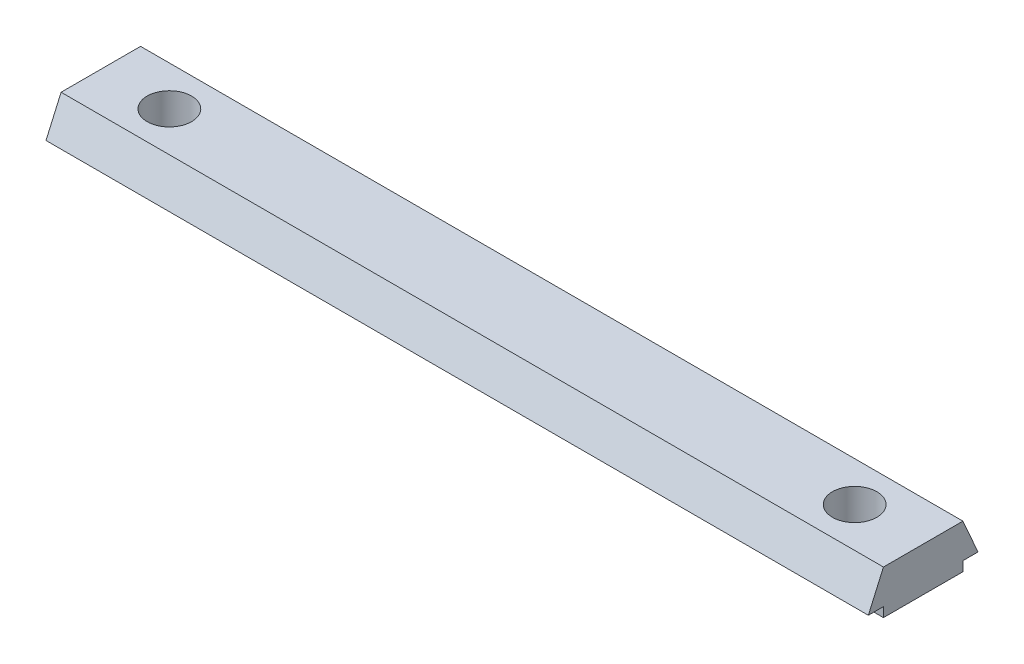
ISO-10303-21;
HEADER;
FILE_DESCRIPTION(('STEP AP214'),'2;1');
FILE_NAME('part.step','',(''),(''),'','','');
FILE_SCHEMA(('AUTOMOTIVE_DESIGN { 1 0 10303 214 1 1 1 1 }'));
ENDSEC;
DATA;
#1=APPLICATION_CONTEXT('core data for automotive mechanical design processes');
#2=APPLICATION_PROTOCOL_DEFINITION('international standard','automotive_design',2000,#1);
#3=PRODUCT_CONTEXT('',#1,'mechanical');
#4=PRODUCT('Part','Part','',(#3));
#5=PRODUCT_RELATED_PRODUCT_CATEGORY('part','',(#4));
#6=PRODUCT_DEFINITION_FORMATION('','',#4);
#7=PRODUCT_DEFINITION_CONTEXT('part definition',#1,'design');
#8=PRODUCT_DEFINITION('design','',#6,#7);
#9=PRODUCT_DEFINITION_SHAPE('','',#8);
#10=(LENGTH_UNIT() NAMED_UNIT(*) SI_UNIT(.MILLI.,.METRE.));
#11=(NAMED_UNIT(*) PLANE_ANGLE_UNIT() SI_UNIT($,.RADIAN.));
#12=(NAMED_UNIT(*) SI_UNIT($,.STERADIAN.) SOLID_ANGLE_UNIT());
#13=UNCERTAINTY_MEASURE_WITH_UNIT(LENGTH_MEASURE(1.E-05),#10,'distance_accuracy_value','');
#14=(GEOMETRIC_REPRESENTATION_CONTEXT(3) GLOBAL_UNCERTAINTY_ASSIGNED_CONTEXT((#13)) GLOBAL_UNIT_ASSIGNED_CONTEXT((#10,
#11,#12)) REPRESENTATION_CONTEXT('',''));
#15=CARTESIAN_POINT('',(0.,0.,0.));
#16=DIRECTION('',(0.,0.,1.));
#17=DIRECTION('',(1.,0.,0.));
#18=AXIS2_PLACEMENT_3D('',#15,#16,#17);
#19=CARTESIAN_POINT('',(60.,0.,2.9));
#20=DIRECTION('',(0.,0.,-1.));
#21=DIRECTION('',(-1.,0.,0.));
#22=AXIS2_PLACEMENT_3D('',#19,#20,#21);
#23=PLANE('',#22);
#24=DIRECTION('',(0.,-1.,0.));
#25=VECTOR('',#24,1.);
#26=CARTESIAN_POINT('',(0.,0.,2.9));
#27=LINE('',#26,#25);
#28=CARTESIAN_POINT('',(0.,0.7,2.9));
#29=VERTEX_POINT('',#28);
#30=CARTESIAN_POINT('',(0.,0.,2.9));
#31=VERTEX_POINT('',#30);
#32=EDGE_CURVE('E132',#29,#31,#27,.T.);
#33=ORIENTED_EDGE('',*,*,#32,.T.);
#34=DIRECTION('',(-1.,0.,0.));
#35=VECTOR('',#34,1.);
#36=CARTESIAN_POINT('',(60.,0.,2.9));
#37=LINE('',#36,#35);
#38=CARTESIAN_POINT('',(60.,0.,2.9));
#39=VERTEX_POINT('',#38);
#40=EDGE_CURVE('E11',#39,#31,#37,.T.);
#41=ORIENTED_EDGE('',*,*,#40,.F.);
#42=DIRECTION('',(0.,-1.,0.));
#43=VECTOR('',#42,1.);
#44=CARTESIAN_POINT('',(60.,0.,2.9));
#45=LINE('',#44,#43);
#46=CARTESIAN_POINT('',(60.,0.7,2.9));
#47=VERTEX_POINT('',#46);
#48=EDGE_CURVE('E147',#47,#39,#45,.T.);
#49=ORIENTED_EDGE('',*,*,#48,.F.);
#50=DIRECTION('',(-1.,0.,0.));
#51=VECTOR('',#50,1.);
#52=CARTESIAN_POINT('',(60.,0.7,2.9));
#53=LINE('',#52,#51);
#54=EDGE_CURVE('E128',#47,#29,#53,.T.);
#55=ORIENTED_EDGE('',*,*,#54,.T.);
#56=EDGE_LOOP('',(#33,#41,#49,#55));
#57=FACE_BOUND('',#56,.T.);
#58=ADVANCED_FACE('F36',(#57),#23,.F.);
#59=CARTESIAN_POINT('',(60.,0.,2.9));
#60=DIRECTION('',(0.,1.,0.));
#61=DIRECTION('',(0.,0.,1.));
#62=AXIS2_PLACEMENT_3D('',#59,#60,#61);
#63=PLANE('',#62);
#64=CARTESIAN_POINT('',(55.,0.,0.));
#65=DIRECTION('',(0.,1.,0.));
#66=DIRECTION('',(0.,0.,1.));
#67=AXIS2_PLACEMENT_3D('',#64,#65,#66);
#68=CIRCLE('',#67,1.621);
#69=CARTESIAN_POINT('',(55.,0.,1.621));
#70=VERTEX_POINT('',#69);
#71=EDGE_CURVE('E188',#70,#70,#68,.T.);
#72=ORIENTED_EDGE('',*,*,#71,.T.);
#73=EDGE_LOOP('',(#72));
#74=FACE_BOUND('',#73,.T.);
#75=CARTESIAN_POINT('',(5.,0.,0.));
#76=DIRECTION('',(0.,1.,0.));
#77=DIRECTION('',(0.,0.,1.));
#78=AXIS2_PLACEMENT_3D('',#75,#76,#77);
#79=CIRCLE('',#78,1.621);
#80=CARTESIAN_POINT('',(5.,0.,1.621));
#81=VERTEX_POINT('',#80);
#82=EDGE_CURVE('E136',#81,#81,#79,.T.);
#83=ORIENTED_EDGE('',*,*,#82,.T.);
#84=EDGE_LOOP('',(#83));
#85=FACE_BOUND('',#84,.T.);
#86=DIRECTION('',(0.,0.,-1.));
#87=VECTOR('',#86,1.);
#88=CARTESIAN_POINT('',(0.,0.,2.9));
#89=LINE('',#88,#87);
#90=CARTESIAN_POINT('',(0.,0.,-2.9));
#91=VERTEX_POINT('',#90);
#92=EDGE_CURVE('E135',#31,#91,#89,.T.);
#93=ORIENTED_EDGE('',*,*,#92,.T.);
#94=DIRECTION('',(-1.,0.,0.));
#95=VECTOR('',#94,1.);
#96=CARTESIAN_POINT('',(60.,0.,-2.9));
#97=LINE('',#96,#95);
#98=CARTESIAN_POINT('',(60.,0.,-2.9));
#99=VERTEX_POINT('',#98);
#100=EDGE_CURVE('E44',#99,#91,#97,.T.);
#101=ORIENTED_EDGE('',*,*,#100,.F.);
#102=DIRECTION('',(0.,0.,-1.));
#103=VECTOR('',#102,1.);
#104=CARTESIAN_POINT('',(60.,0.,2.9));
#105=LINE('',#104,#103);
#106=EDGE_CURVE('E95',#39,#99,#105,.T.);
#107=ORIENTED_EDGE('',*,*,#106,.F.);
#108=ORIENTED_EDGE('',*,*,#40,.T.);
#109=EDGE_LOOP('',(#93,#101,#107,#108));
#110=FACE_BOUND('',#109,.T.);
#111=ADVANCED_FACE('F192',(#74,#85,#110),#63,.F.);
#112=CARTESIAN_POINT('',(60.,0.,-2.9));
#113=DIRECTION('',(0.,0.,1.));
#114=DIRECTION('',(1.,0.,0.));
#115=AXIS2_PLACEMENT_3D('',#112,#113,#114);
#116=PLANE('',#115);
#117=DIRECTION('',(0.,1.,0.));
#118=VECTOR('',#117,1.);
#119=CARTESIAN_POINT('',(0.,0.,-2.9));
#120=LINE('',#119,#118);
#121=CARTESIAN_POINT('',(0.,0.7,-2.9));
#122=VERTEX_POINT('',#121);
#123=EDGE_CURVE('E138',#91,#122,#120,.T.);
#124=ORIENTED_EDGE('',*,*,#123,.T.);
#125=DIRECTION('',(-1.,0.,0.));
#126=VECTOR('',#125,1.);
#127=CARTESIAN_POINT('',(60.,0.7,-2.9));
#128=LINE('',#127,#126);
#129=CARTESIAN_POINT('',(60.,0.7,-2.9));
#130=VERTEX_POINT('',#129);
#131=EDGE_CURVE('E154',#130,#122,#128,.T.);
#132=ORIENTED_EDGE('',*,*,#131,.F.);
#133=DIRECTION('',(0.,1.,0.));
#134=VECTOR('',#133,1.);
#135=CARTESIAN_POINT('',(60.,0.,-2.9));
#136=LINE('',#135,#134);
#137=EDGE_CURVE('E162',#99,#130,#136,.T.);
#138=ORIENTED_EDGE('',*,*,#137,.F.);
#139=ORIENTED_EDGE('',*,*,#100,.T.);
#140=EDGE_LOOP('',(#124,#132,#138,#139));
#141=FACE_BOUND('',#140,.T.);
#142=ADVANCED_FACE('F160',(#141),#116,.F.);
#143=CARTESIAN_POINT('',(60.,0.7,-4.));
#144=DIRECTION('',(0.,1.,0.));
#145=DIRECTION('',(0.,0.,1.));
#146=AXIS2_PLACEMENT_3D('',#143,#144,#145);
#147=PLANE('',#146);
#148=DIRECTION('',(0.,0.,-1.));
#149=VECTOR('',#148,1.);
#150=CARTESIAN_POINT('',(0.,0.7,-4.));
#151=LINE('',#150,#149);
#152=CARTESIAN_POINT('',(0.,0.7,-4.));
#153=VERTEX_POINT('',#152);
#154=EDGE_CURVE('E140',#122,#153,#151,.T.);
#155=ORIENTED_EDGE('',*,*,#154,.T.);
#156=DIRECTION('',(-1.,0.,0.));
#157=VECTOR('',#156,1.);
#158=CARTESIAN_POINT('',(60.,0.7,-4.));
#159=LINE('',#158,#157);
#160=CARTESIAN_POINT('',(60.,0.7,-4.));
#161=VERTEX_POINT('',#160);
#162=EDGE_CURVE('E151',#161,#153,#159,.T.);
#163=ORIENTED_EDGE('',*,*,#162,.F.);
#164=DIRECTION('',(0.,0.,-1.));
#165=VECTOR('',#164,1.);
#166=CARTESIAN_POINT('',(60.,0.7,-4.));
#167=LINE('',#166,#165);
#168=EDGE_CURVE('E174',#130,#161,#167,.T.);
#169=ORIENTED_EDGE('',*,*,#168,.F.);
#170=ORIENTED_EDGE('',*,*,#131,.T.);
#171=EDGE_LOOP('',(#155,#163,#169,#170));
#172=FACE_BOUND('',#171,.T.);
#173=ADVANCED_FACE('F170',(#172),#147,.F.);
#174=CARTESIAN_POINT('',(60.,3.2,-2.9));
#175=DIRECTION('',(0.,-0.402738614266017,0.915315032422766));
#176=DIRECTION('',(0.,-0.915315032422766,-0.402738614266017));
#177=AXIS2_PLACEMENT_3D('',#174,#175,#176);
#178=PLANE('',#177);
#179=DIRECTION('',(0.,0.915315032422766,0.402738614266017));
#180=VECTOR('',#179,1.);
#181=CARTESIAN_POINT('',(0.,3.2,-2.9));
#182=LINE('',#181,#180);
#183=CARTESIAN_POINT('',(0.,3.2,-2.9));
#184=VERTEX_POINT('',#183);
#185=EDGE_CURVE('E142',#153,#184,#182,.T.);
#186=ORIENTED_EDGE('',*,*,#185,.T.);
#187=DIRECTION('',(-1.,0.,0.));
#188=VECTOR('',#187,1.);
#189=CARTESIAN_POINT('',(60.,3.2,-2.9));
#190=LINE('',#189,#188);
#191=CARTESIAN_POINT('',(60.,3.2,-2.9));
#192=VERTEX_POINT('',#191);
#193=EDGE_CURVE('E123',#192,#184,#190,.T.);
#194=ORIENTED_EDGE('',*,*,#193,.F.);
#195=DIRECTION('',(0.,0.915315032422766,0.402738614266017));
#196=VECTOR('',#195,1.);
#197=CARTESIAN_POINT('',(60.,3.2,-2.9));
#198=LINE('',#197,#196);
#199=EDGE_CURVE('E114',#161,#192,#198,.T.);
#200=ORIENTED_EDGE('',*,*,#199,.F.);
#201=ORIENTED_EDGE('',*,*,#162,.T.);
#202=EDGE_LOOP('',(#186,#194,#200,#201));
#203=FACE_BOUND('',#202,.T.);
#204=ADVANCED_FACE('F173',(#203),#178,.F.);
#205=CARTESIAN_POINT('',(60.,3.2,2.9));
#206=DIRECTION('',(0.,-1.,0.));
#207=DIRECTION('',(0.,0.,-1.));
#208=AXIS2_PLACEMENT_3D('',#205,#206,#207);
#209=PLANE('',#208);
#210=CARTESIAN_POINT('',(55.,3.2,0.));
#211=DIRECTION('',(0.,1.,0.));
#212=DIRECTION('',(0.,0.,1.));
#213=AXIS2_PLACEMENT_3D('',#210,#211,#212);
#214=CIRCLE('',#213,1.621);
#215=CARTESIAN_POINT('',(55.,3.2,1.621));
#216=VERTEX_POINT('',#215);
#217=EDGE_CURVE('E185',#216,#216,#214,.T.);
#218=ORIENTED_EDGE('',*,*,#217,.F.);
#219=EDGE_LOOP('',(#218));
#220=FACE_BOUND('',#219,.T.);
#221=CARTESIAN_POINT('',(5.,3.2,0.));
#222=DIRECTION('',(0.,1.,0.));
#223=DIRECTION('',(0.,0.,1.));
#224=AXIS2_PLACEMENT_3D('',#221,#222,#223);
#225=CIRCLE('',#224,1.621);
#226=CARTESIAN_POINT('',(5.,3.2,1.621));
#227=VERTEX_POINT('',#226);
#228=EDGE_CURVE('E182',#227,#227,#225,.T.);
#229=ORIENTED_EDGE('',*,*,#228,.F.);
#230=EDGE_LOOP('',(#229));
#231=FACE_BOUND('',#230,.T.);
#232=DIRECTION('',(0.,0.,1.));
#233=VECTOR('',#232,1.);
#234=CARTESIAN_POINT('',(0.,3.2,2.9));
#235=LINE('',#234,#233);
#236=CARTESIAN_POINT('',(0.,3.2,2.9));
#237=VERTEX_POINT('',#236);
#238=EDGE_CURVE('E122',#184,#237,#235,.T.);
#239=ORIENTED_EDGE('',*,*,#238,.T.);
#240=DIRECTION('',(-1.,0.,0.));
#241=VECTOR('',#240,1.);
#242=CARTESIAN_POINT('',(60.,3.2,2.9));
#243=LINE('',#242,#241);
#244=CARTESIAN_POINT('',(60.,3.2,2.9));
#245=VERTEX_POINT('',#244);
#246=EDGE_CURVE('E119',#245,#237,#243,.T.);
#247=ORIENTED_EDGE('',*,*,#246,.F.);
#248=DIRECTION('',(0.,0.,1.));
#249=VECTOR('',#248,1.);
#250=CARTESIAN_POINT('',(60.,3.2,2.9));
#251=LINE('',#250,#249);
#252=EDGE_CURVE('E108',#192,#245,#251,.T.);
#253=ORIENTED_EDGE('',*,*,#252,.F.);
#254=ORIENTED_EDGE('',*,*,#193,.T.);
#255=EDGE_LOOP('',(#239,#247,#253,#254));
#256=FACE_BOUND('',#255,.T.);
#257=ADVANCED_FACE('F120',(#220,#231,#256),#209,.F.);
#258=CARTESIAN_POINT('',(60.,0.7,4.));
#259=DIRECTION('',(0.,-0.402738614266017,-0.915315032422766));
#260=DIRECTION('',(0.,0.915315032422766,-0.402738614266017));
#261=AXIS2_PLACEMENT_3D('',#258,#259,#260);
#262=PLANE('',#261);
#263=DIRECTION('',(0.,-0.915315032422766,0.402738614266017));
#264=VECTOR('',#263,1.);
#265=CARTESIAN_POINT('',(0.,0.7,4.));
#266=LINE('',#265,#264);
#267=CARTESIAN_POINT('',(0.,0.7,4.));
#268=VERTEX_POINT('',#267);
#269=EDGE_CURVE('E81',#237,#268,#266,.T.);
#270=ORIENTED_EDGE('',*,*,#269,.T.);
#271=DIRECTION('',(-1.,0.,0.));
#272=VECTOR('',#271,1.);
#273=CARTESIAN_POINT('',(60.,0.7,4.));
#274=LINE('',#273,#272);
#275=CARTESIAN_POINT('',(60.,0.7,4.));
#276=VERTEX_POINT('',#275);
#277=EDGE_CURVE('E124',#276,#268,#274,.T.);
#278=ORIENTED_EDGE('',*,*,#277,.F.);
#279=DIRECTION('',(0.,-0.915315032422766,0.402738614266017));
#280=VECTOR('',#279,1.);
#281=CARTESIAN_POINT('',(60.,0.7,4.));
#282=LINE('',#281,#280);
#283=EDGE_CURVE('E112',#245,#276,#282,.T.);
#284=ORIENTED_EDGE('',*,*,#283,.F.);
#285=ORIENTED_EDGE('',*,*,#246,.T.);
#286=EDGE_LOOP('',(#270,#278,#284,#285));
#287=FACE_BOUND('',#286,.T.);
#288=ADVANCED_FACE('F126',(#287),#262,.F.);
#289=CARTESIAN_POINT('',(60.,0.7,2.9));
#290=DIRECTION('',(0.,1.,0.));
#291=DIRECTION('',(0.,0.,1.));
#292=AXIS2_PLACEMENT_3D('',#289,#290,#291);
#293=PLANE('',#292);
#294=DIRECTION('',(0.,0.,-1.));
#295=VECTOR('',#294,1.);
#296=CARTESIAN_POINT('',(0.,0.7,2.9));
#297=LINE('',#296,#295);
#298=EDGE_CURVE('E87',#268,#29,#297,.T.);
#299=ORIENTED_EDGE('',*,*,#298,.T.);
#300=ORIENTED_EDGE('',*,*,#54,.F.);
#301=DIRECTION('',(0.,0.,-1.));
#302=VECTOR('',#301,1.);
#303=CARTESIAN_POINT('',(60.,0.7,2.9));
#304=LINE('',#303,#302);
#305=EDGE_CURVE('E52',#276,#47,#304,.T.);
#306=ORIENTED_EDGE('',*,*,#305,.F.);
#307=ORIENTED_EDGE('',*,*,#277,.T.);
#308=EDGE_LOOP('',(#299,#300,#306,#307));
#309=FACE_BOUND('',#308,.T.);
#310=ADVANCED_FACE('F223',(#309),#293,.F.);
#311=CARTESIAN_POINT('',(60.,0.,0.));
#312=DIRECTION('',(1.,0.,0.));
#313=DIRECTION('',(0.,0.,-1.));
#314=AXIS2_PLACEMENT_3D('',#311,#312,#313);
#315=PLANE('',#314);
#316=ORIENTED_EDGE('',*,*,#48,.T.);
#317=ORIENTED_EDGE('',*,*,#106,.T.);
#318=ORIENTED_EDGE('',*,*,#137,.T.);
#319=ORIENTED_EDGE('',*,*,#168,.T.);
#320=ORIENTED_EDGE('',*,*,#199,.T.);
#321=ORIENTED_EDGE('',*,*,#252,.T.);
#322=ORIENTED_EDGE('',*,*,#283,.T.);
#323=ORIENTED_EDGE('',*,*,#305,.T.);
#324=EDGE_LOOP('',(#316,#317,#318,#319,#320,#321,#322,#323));
#325=FACE_BOUND('',#324,.T.);
#326=ADVANCED_FACE('F110',(#325),#315,.T.);
#327=CARTESIAN_POINT('',(0.,0.,0.));
#328=DIRECTION('',(1.,0.,0.));
#329=DIRECTION('',(0.,0.,-1.));
#330=AXIS2_PLACEMENT_3D('',#327,#328,#329);
#331=PLANE('',#330);
#332=ORIENTED_EDGE('',*,*,#32,.F.);
#333=ORIENTED_EDGE('',*,*,#298,.F.);
#334=ORIENTED_EDGE('',*,*,#269,.F.);
#335=ORIENTED_EDGE('',*,*,#238,.F.);
#336=ORIENTED_EDGE('',*,*,#185,.F.);
#337=ORIENTED_EDGE('',*,*,#154,.F.);
#338=ORIENTED_EDGE('',*,*,#123,.F.);
#339=ORIENTED_EDGE('',*,*,#92,.F.);
#340=EDGE_LOOP('',(#332,#333,#334,#335,#336,#337,#338,#339));
#341=FACE_BOUND('',#340,.T.);
#342=ADVANCED_FACE('F166',(#341),#331,.F.);
#343=CARTESIAN_POINT('',(5.,3.2,0.));
#344=DIRECTION('',(0.,1.,0.));
#345=DIRECTION('',(0.,0.,1.));
#346=AXIS2_PLACEMENT_3D('',#343,#344,#345);
#347=CYLINDRICAL_SURFACE('',#346,1.621);
#348=ORIENTED_EDGE('',*,*,#82,.F.);
#349=EDGE_LOOP('',(#348));
#350=FACE_BOUND('',#349,.T.);
#351=ORIENTED_EDGE('',*,*,#228,.T.);
#352=EDGE_LOOP('',(#351));
#353=FACE_BOUND('',#352,.T.);
#354=ADVANCED_FACE('F198',(#350,#353),#347,.F.);
#355=CARTESIAN_POINT('',(55.,3.2,0.));
#356=DIRECTION('',(0.,1.,0.));
#357=DIRECTION('',(0.,0.,1.));
#358=AXIS2_PLACEMENT_3D('',#355,#356,#357);
#359=CYLINDRICAL_SURFACE('',#358,1.621);
#360=ORIENTED_EDGE('',*,*,#71,.F.);
#361=EDGE_LOOP('',(#360));
#362=FACE_BOUND('',#361,.T.);
#363=ORIENTED_EDGE('',*,*,#217,.T.);
#364=EDGE_LOOP('',(#363));
#365=FACE_BOUND('',#364,.T.);
#366=ADVANCED_FACE('F195',(#362,#365),#359,.F.);
#367=CLOSED_SHELL('',(#58,#111,#142,#173,#204,#257,#288,#310,#326,#342,#354,#366));
#368=MANIFOLD_SOLID_BREP('B2',#367);
#369=ADVANCED_BREP_SHAPE_REPRESENTATION('',(#18,#368),#14);
#370=SHAPE_DEFINITION_REPRESENTATION(#9,#369);
ENDSEC;
END-ISO-10303-21;
